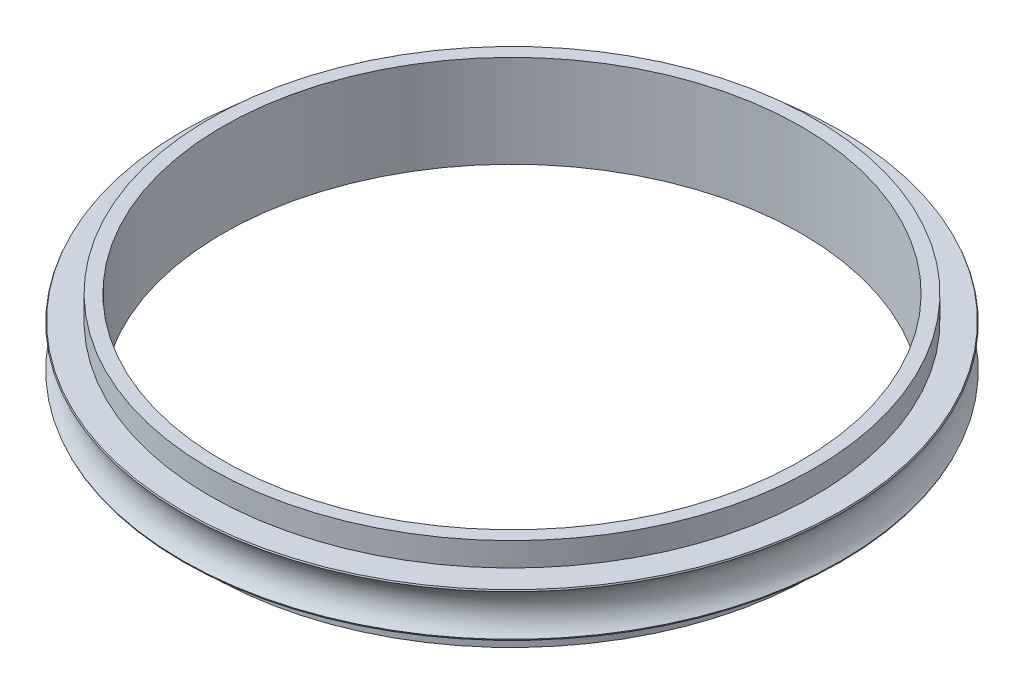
from build123d import *

# Parameters (mm, degrees)
BOSS_EXTRU_1_REACH = 43.082
ESQUISSE2_R        = 26.15
ESQUISSE2_R_2      = 25
ESQUISSE3_W        = 8.095707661
ESQUISSE3_H        = 3.682955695
ESQUISSE3_H_2      = 4.16126163


with BuildPart() as part:
    # Esquisse1 → R_volution1 (revolve)
    with BuildSketch(Plane.XY, mode=Mode.PRIVATE) as r_volution1_sk:
        with BuildLine():
            Line((28.423115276, -1.95), (28.493380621, -1.778844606))
            ThreePointArc((28.493380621, -1.778844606), (27.750000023, -2.5e-07), (28.493380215, 1.778844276))
            Line((28.493380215, 1.778844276), (28.423114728, 1.95000002))
            Line((28.423114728, 1.95000002), (26, 1.95000002))
            Line((26, 1.95000002), (26, 3.95))
            Line((26, 3.95), (25, 3.95))
            Line((25, 3.95), (25, -4.05))
            Line((25, -4.05), (26, -4.05))
            Line((26, -4.05), (26, -1.95))
            Line((26, -1.95), (28.423115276, -1.95))
        make_face()
    revolve(r_volution1_sk.sketch.rotate(Axis((0, 3.95, 0), (0, -1, 0)), 270), axis=Axis((0, 3.95, 0), (0, -1, 0)))

    # Boss.-Extru.1: up to this face of the body (flat: up to its plane)
    boss_extru_1_end = Plane(part.part.faces().sort_by_distance((0, -4.05, 25.735391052))[0])
    # Esquisse2 → Boss.-Extru.1 (add, up to the picked face)
    with BuildSketch(Plane(origin=(0, 3.95, 0), x_dir=(1, 0, 0), z_dir=(0, 1, 0)), mode=Mode.PRIVATE) as boss_extru_1_sk1:
        with Locations(Location((0, 0, 0), (0, 0, 270))):
            Circle(ESQUISSE2_R)
        with Locations(Location((0, 0, 0), (0, 0, 90))):
            Circle(ESQUISSE2_R_2, mode=Mode.SUBTRACT)
    boss_extru_1_tool1 = split(extrude(boss_extru_1_sk1.sketch, amount=-BOSS_EXTRU_1_REACH, mode=Mode.PRIVATE), bisect_by=boss_extru_1_end, keep=Keep.BOTH, mode=Mode.PRIVATE)
    add(boss_extru_1_tool1.solids().sort_by(Axis((0, 3.95, -25.410366), (0, -1, 0)))[0])

    # Esquisse3 → Enl_vement de mati_re-R_volution1 (revolve, cut)
    with BuildSketch(Plane.XY, mode=Mode.PRIVATE) as enl_vement_de_mati_re_r_volution1_sk:
        with Locations((-30.197853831, 3.741477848)):
            Rectangle(ESQUISSE3_W, ESQUISSE3_H)
        with Locations((-30.197853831, -3.980630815)):
            Rectangle(ESQUISSE3_W, ESQUISSE3_H_2)
    revolve(enl_vement_de_mati_re_r_volution1_sk.sketch.rotate(Axis((0, 0, 0), (0, 1, 0)), 270), axis=Axis((0, 0, 0), (0, 1, 0)), mode=Mode.SUBTRACT)


solid = part.part
